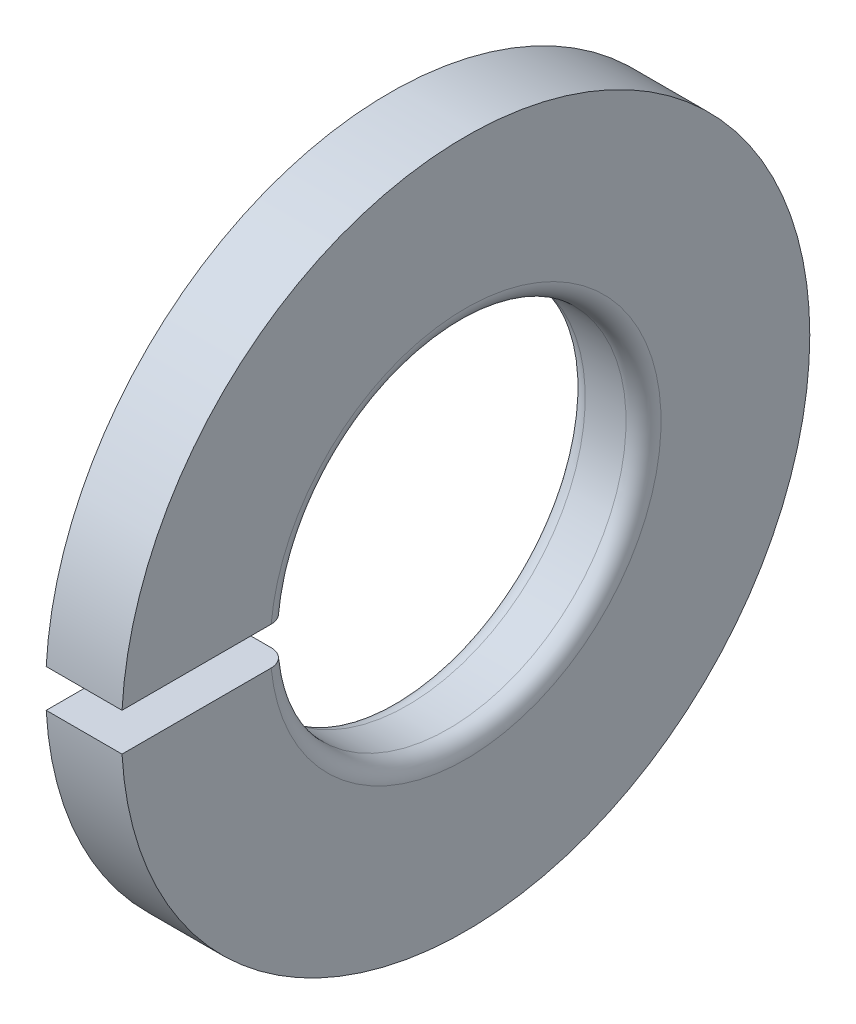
from build123d import *

# Parameters (mm, degrees)
SKETCH2_W = 0.65
SKETCH2_H = 6.018
GAP_DEPTH = 9.444524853


with BuildPart() as part:
    # Sketch1 → Base-Revolve (revolve)
    with BuildSketch(Plane.XY, mode=Mode.PRIVATE) as base_revolve_sk:
        with BuildLine():
            Line((0, 3.35), (0, 5.9))
            Line((0, 5.9), (-1.3, 5.9))
            Line((-1.3, 5.9), (-1.3, 3.35))
            ThreePointArc((-1.3, 3.35), (-1.212132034, 3.137867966), (-1, 3.05))
            Line((-1, 3.05), (-0.3, 3.05))
            ThreePointArc((-0.3, 3.05), (-0.087867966, 3.137867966), (0, 3.35))
        make_face()
    revolve(base_revolve_sk.sketch.rotate(Axis((-34.925, 0, 0), (1, 0, 0)), 90), axis=Axis((-34.925, 0, 0), (1, 0, 0)))

    # Sketch2 → Gap (cut, through all)
    with BuildSketch(Plane(origin=(0, 0, 0), x_dir=(0, -1, 0), z_dir=(-1, 0, 0))):
        with Locations((0, 3.009)):
            Rectangle(SKETCH2_W, SKETCH2_H)
    extrude(amount=GAP_DEPTH, mode=Mode.SUBTRACT)


solid = part.part
